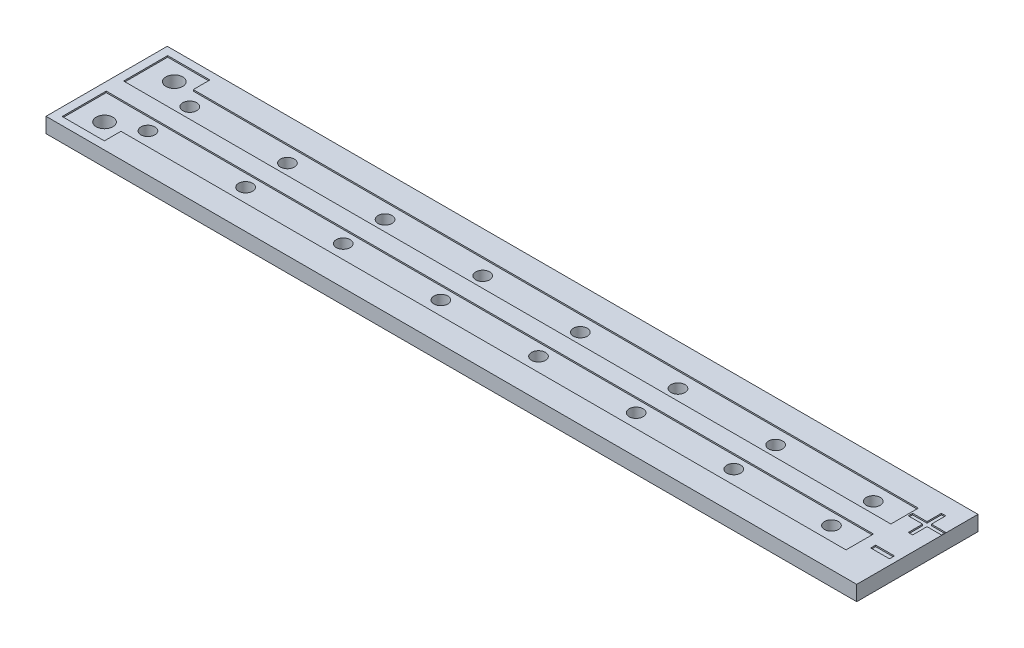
from build123d import *

# Parameters (mm, degrees)
ESQUISSE1_W             = 58.12
ESQUISSE1_H             = 8.69502075
ESQUISSE1_R             = 0.6
ESQUISSE1_R_2           = 0.5
EXTRUSION1_DEPTH        = 1.08
ESQUISSE2_W             = 1.346153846
ESQUISSE2_H             = 0.358974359
ENL_V_MAT_EXTRU_1_DEPTH = 0.1


with BuildPart() as part:
    # Esquisse1 → Extrusion1 (new body)
    with BuildSketch(Plane(origin=(0, 0, 0), x_dir=(1, 0, 0), z_dir=(0, 1, 0))):
        with Locations((29.06, 4.347510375)):
            Rectangle(ESQUISSE1_W, ESQUISSE1_H)
        with Locations(Location((2.35, 6.847510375, 0), (0, 0, 270))):
            Circle(ESQUISSE1_R, mode=Mode.SUBTRACT)
        with Locations(Location((4.46, 5.847510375, 0), (0, 0, 270))):
            Circle(ESQUISSE1_R_2, mode=Mode.SUBTRACT)
        with Locations(Location((11.46, 5.847510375, 0), (0, 0, 270))):
            Circle(ESQUISSE1_R_2, mode=Mode.SUBTRACT)
        with Locations(Location((18.46, 5.847510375, 0), (0, 0, 270))):
            Circle(ESQUISSE1_R_2, mode=Mode.SUBTRACT)
        with Locations(Location((25.46, 5.847510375, 0), (0, 0, 270))):
            Circle(ESQUISSE1_R_2, mode=Mode.SUBTRACT)
        with Locations(Location((32.46, 5.847510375, 0), (0, 0, 270))):
            Circle(ESQUISSE1_R_2, mode=Mode.SUBTRACT)
        with Locations(Location((39.46, 5.847510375, 0), (0, 0, 270))):
            Circle(ESQUISSE1_R_2, mode=Mode.SUBTRACT)
        with Locations(Location((46.46, 5.847510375, 0), (0, 0, 270))):
            Circle(ESQUISSE1_R_2, mode=Mode.SUBTRACT)
        with Locations(Location((53.46, 5.847510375, 0), (0, 0, 270))):
            Circle(ESQUISSE1_R_2, mode=Mode.SUBTRACT)
        with Locations(Location((53.46, 2.847510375, 0), (0, 0, 90))):
            Circle(ESQUISSE1_R_2, mode=Mode.SUBTRACT)
        with Locations(Location((46.46, 2.847510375, 0), (0, 0, 90))):
            Circle(ESQUISSE1_R_2, mode=Mode.SUBTRACT)
        with Locations(Location((39.46, 2.847510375, 0), (0, 0, 90))):
            Circle(ESQUISSE1_R_2, mode=Mode.SUBTRACT)
        with Locations(Location((32.46, 2.847510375, 0), (0, 0, 90))):
            Circle(ESQUISSE1_R_2, mode=Mode.SUBTRACT)
        with Locations(Location((25.46, 2.847510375, 0), (0, 0, 90))):
            Circle(ESQUISSE1_R_2, mode=Mode.SUBTRACT)
        with Locations(Location((18.46, 2.847510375, 0), (0, 0, 90))):
            Circle(ESQUISSE1_R_2, mode=Mode.SUBTRACT)
        with Locations(Location((11.46, 2.847510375, 0), (0, 0, 90))):
            Circle(ESQUISSE1_R_2, mode=Mode.SUBTRACT)
        with Locations(Location((4.46, 2.847510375, 0), (0, 0, 90))):
            Circle(ESQUISSE1_R_2, mode=Mode.SUBTRACT)
        with Locations(Location((2.35, 1.847510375, 0), (0, 0, 90))):
            Circle(ESQUISSE1_R, mode=Mode.SUBTRACT)
    extrude(amount=EXTRUSION1_DEPTH)

    # Esquisse2 → Enl_v. mat.-Extru.1 (cut)
    with BuildSketch(Plane(origin=(0, 1.08, 0), x_dir=(-1, 0, 0), z_dir=(0, 1, 0))):
        Polygon((-55.597166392, -3.724828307), (-0.592578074, -3.724828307), (-0.592578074, -0.564392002), (-3.619238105, -0.564392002), (-3.619238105, -1.755863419), (-55.597166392, -1.755863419), align=None)
        Polygon((-3.619238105, -6.939157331), (-3.619238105, -8.130628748), (-0.592578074, -8.130628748), (-0.592578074, -4.970192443), (-55.597166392, -4.970192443), (-55.597166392, -6.939157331), align=None)
        Polygon((-57.057255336, -6.102090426), (-57.057255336, -5.070039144), (-56.743152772, -5.070039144), (-56.743152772, -6.102090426), (-55.71110149, -6.102090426), (-55.71110149, -6.41619299), (-56.743152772, -6.41619299), (-56.743152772, -7.448244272), (-57.057255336, -7.448244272), (-57.057255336, -6.41619299), (-58.089306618, -6.41619299), (-58.089306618, -6.102090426), align=None)
        with Locations((-57.035859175, -2.93920464)):
            Rectangle(ESQUISSE2_W, ESQUISSE2_H)
    extrude(amount=-ENL_V_MAT_EXTRU_1_DEPTH, mode=Mode.SUBTRACT)


solid = part.part
